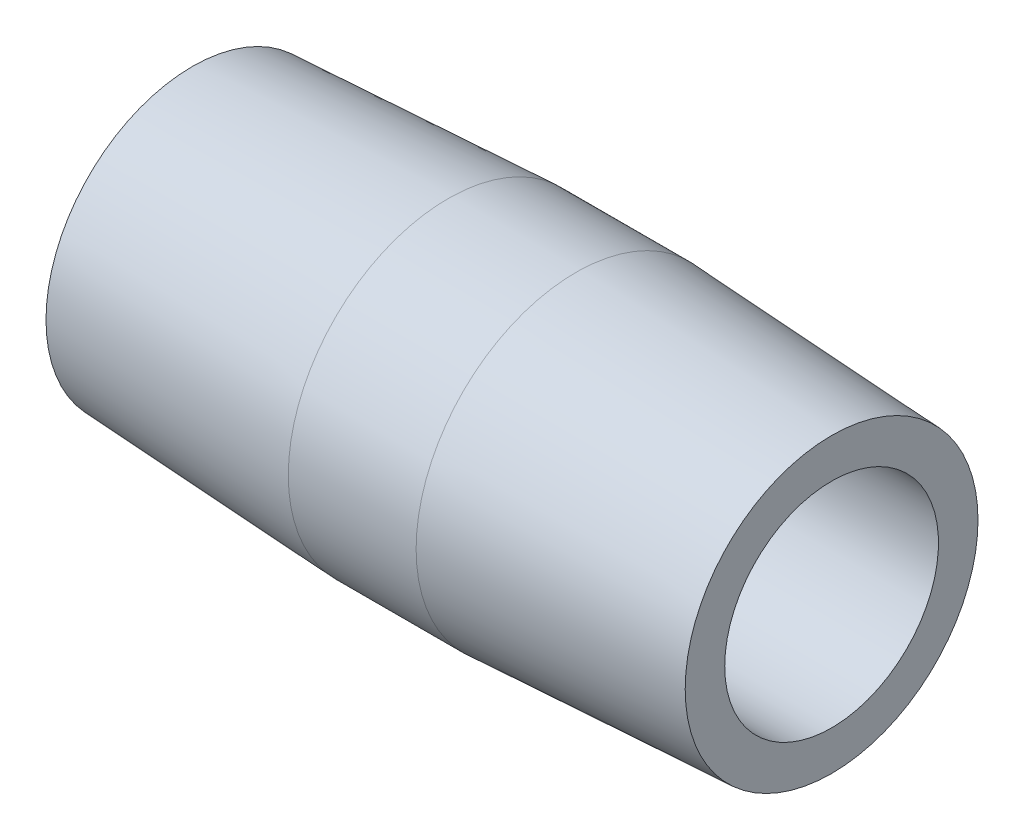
from build123d import *


with BuildPart() as part:
    # Sketch2 → Revolve1 (revolve)
    with BuildSketch(Plane.XY, mode=Mode.PRIVATE) as revolve1_sk:
        Polygon((6.35, 3.96875), (0, 3.635960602), (0, 2.6543), (15.875, 2.6543), (15.875, 3.635960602), (9.525, 3.96875), align=None)
    revolve(revolve1_sk.sketch.rotate(Axis((0.476141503, 0, 0), (1, 0, 0)), 90), axis=Axis((0.476141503, 0, 0), (1, 0, 0)))


solid = part.part
